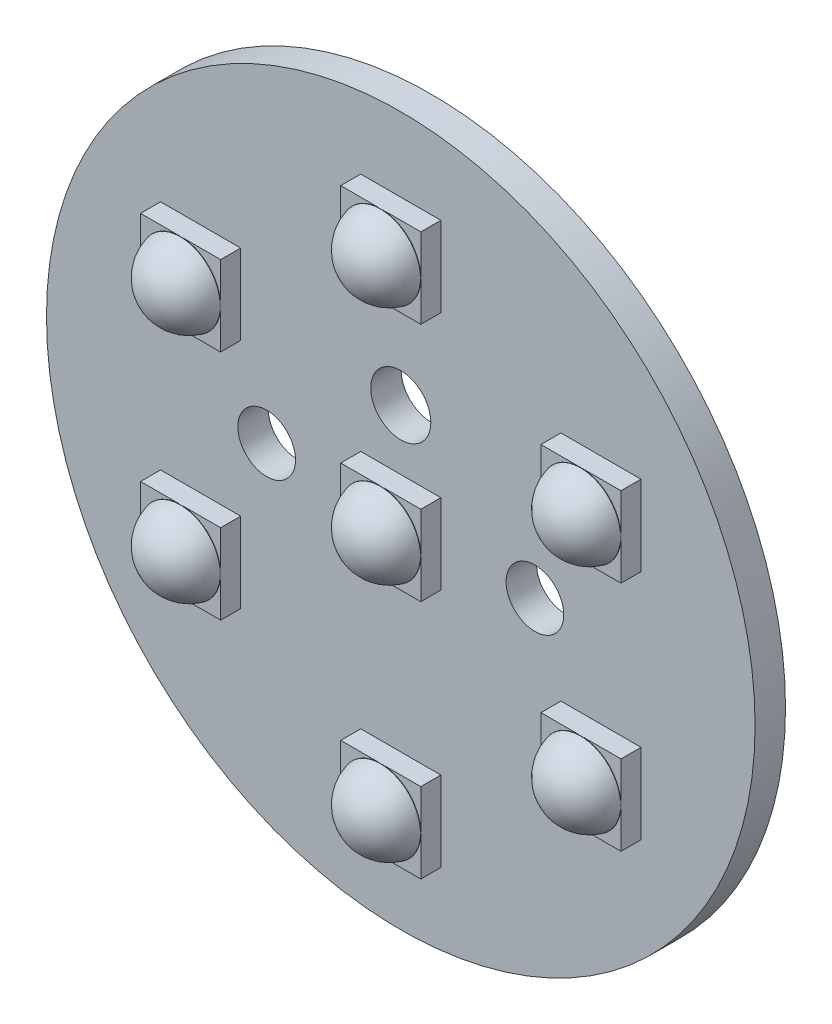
from build123d import *

# Parameters (mm, degrees)
SKETCH1_R           = 22.479
BOSS_EXTRUDE1_DEPTH = 1.9304
SKETCH2_W           = 5.08
SKETCH2_H           = 5.08
BOSS_EXTRUDE2_DEPTH = 1.27
BOSS_EXTRUDE3_DEPTH = 0.0254
DOME1_FACE_RADIUS   = 2.54
DOME1_HEIGHT        = 2.032
DOME2_FACE_RADIUS   = 2.54
DOME2_HEIGHT        = 2.032
DOME3_FACE_RADIUS   = 2.54
DOME3_HEIGHT        = 2.032
DOME4_FACE_RADIUS   = 2.54
DOME4_HEIGHT        = 2.032
DOME5_FACE_RADIUS   = 2.54
DOME5_HEIGHT        = 2.032
DOME6_FACE_RADIUS   = 2.54
DOME6_HEIGHT        = 2.032
DOME7_FACE_RADIUS   = 2.54
DOME7_HEIGHT        = 2.032
SKETCH8_R           = 1.8288
SKETCH8_R_2         = 1.905
CUT_EXTRUDE1_DEPTH  = 32.963768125


with BuildPart() as part:
    # Sketch1 → Boss-Extrude1 (new body)
    with BuildSketch(Plane.XY):
        with Locations(Location((0, 0, 0), (0, 0, 180))):
            Circle(SKETCH1_R)
    extrude(amount=BOSS_EXTRUDE1_DEPTH)

    # Sketch2 → Boss-Extrude2 (add)
    with BuildSketch(Plane.XY.offset(1.9304)):
        with Locations((12.7, 7.366)):
            Rectangle(SKETCH2_W, SKETCH2_H)
        with Locations((0, 15.24)):
            Rectangle(SKETCH2_W, SKETCH2_H)
        with Locations((-12.7, 7.366)):
            Rectangle(SKETCH2_W, SKETCH2_H)
        Rectangle(SKETCH2_W, SKETCH2_H)
        with Locations((12.7, -7.366)):
            Rectangle(SKETCH2_W, SKETCH2_H)
        with Locations((0, -15.24)):
            Rectangle(SKETCH2_W, SKETCH2_H)
        with Locations((-12.7, -7.366)):
            Rectangle(SKETCH2_W, SKETCH2_H)
    extrude(amount=BOSS_EXTRUDE2_DEPTH)

    # Sketch5 → Boss-Extrude3 (add)
    with BuildSketch(Plane.XY.offset(3.2004)):
        with BuildLine():
            ThreePointArc((-12.7, 4.826), (-10.903948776, 5.569948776), (-10.16, 7.366))
            ThreePointArc((-10.16, 7.366), (-10.903948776, 9.162051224), (-12.7, 9.906))
            ThreePointArc((-12.7, 9.906), (-14.496051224, 9.162051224), (-15.24, 7.366))
            ThreePointArc((-15.24, 7.366), (-14.496051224, 5.569948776), (-12.7, 4.826))
        make_face()
        with BuildLine():
            ThreePointArc((0, 12.7), (1.796051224, 13.443948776), (2.54, 15.24))
            ThreePointArc((2.54, 15.24), (1.796051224, 17.036051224), (0, 17.78))
            ThreePointArc((0, 17.78), (-1.796051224, 17.036051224), (-2.54, 15.24))
            ThreePointArc((-2.54, 15.24), (-1.796051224, 13.443948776), (0, 12.7))
        make_face()
        with BuildLine():
            ThreePointArc((0, -2.54), (1.796051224, -1.796051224), (2.54, 0))
            ThreePointArc((2.54, 0), (1.796051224, 1.796051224), (0, 2.54))
            ThreePointArc((0, 2.54), (-1.796051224, 1.796051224), (-2.54, 0))
            ThreePointArc((-2.54, 0), (-1.796051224, -1.796051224), (0, -2.54))
        make_face()
        with BuildLine():
            ThreePointArc((12.7, 4.826), (14.496051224, 5.569948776), (15.24, 7.366))
            ThreePointArc((15.24, 7.366), (14.496051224, 9.162051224), (12.7, 9.906))
            ThreePointArc((12.7, 9.906), (10.903948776, 9.162051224), (10.16, 7.366))
            ThreePointArc((10.16, 7.366), (10.903948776, 5.569948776), (12.7, 4.826))
        make_face()
        with BuildLine():
            ThreePointArc((12.7, -9.906), (14.496051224, -9.162051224), (15.24, -7.366))
            ThreePointArc((15.24, -7.366), (14.496051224, -5.569948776), (12.7, -4.826))
            ThreePointArc((12.7, -4.826), (10.903948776, -5.569948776), (10.16, -7.366))
            ThreePointArc((10.16, -7.366), (10.903948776, -9.162051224), (12.7, -9.906))
        make_face()
        with BuildLine():
            ThreePointArc((0, -17.78), (1.796051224, -17.036051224), (2.54, -15.24))
            ThreePointArc((2.54, -15.24), (1.796051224, -13.443948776), (0, -12.7))
            ThreePointArc((0, -12.7), (-1.796051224, -13.443948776), (-2.54, -15.24))
            ThreePointArc((-2.54, -15.24), (-1.796051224, -17.036051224), (0, -17.78))
        make_face()
        with BuildLine():
            ThreePointArc((-12.7, -9.906), (-10.903948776, -9.162051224), (-10.16, -7.366))
            ThreePointArc((-10.16, -7.366), (-10.903948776, -5.569948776), (-12.7, -4.826))
            ThreePointArc((-12.7, -4.826), (-14.496051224, -5.569948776), (-15.24, -7.366))
            ThreePointArc((-15.24, -7.366), (-14.496051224, -9.162051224), (-12.7, -9.906))
        make_face()
    extrude(amount=BOSS_EXTRUDE3_DEPTH)

    # Dome1: a dome of height H over a round flat face of radius A is a cap of a sphere of radius (A * A + H * H) / (2 * H)
    dome1_r = (DOME1_FACE_RADIUS * DOME1_FACE_RADIUS + DOME1_HEIGHT * DOME1_HEIGHT) / (2 * DOME1_HEIGHT)
    dome1_base = Plane((0, 0, 3.2258), z_dir=(0, 0, 1))
    with Locations(dome1_base.offset(DOME1_HEIGHT - dome1_r)):
        dome1_ball = Sphere(dome1_r, mode=Mode.PRIVATE)
    add(split(dome1_ball, bisect_by=dome1_base, keep=Keep.TOP, mode=Mode.PRIVATE))

    # Dome2: a dome of height H over a round flat face of radius A is a cap of a sphere of radius (A * A + H * H) / (2 * H)
    dome2_r = (DOME2_FACE_RADIUS * DOME2_FACE_RADIUS + DOME2_HEIGHT * DOME2_HEIGHT) / (2 * DOME2_HEIGHT)
    dome2_base = Plane((-12.7, 7.366, 3.2258), z_dir=(0, 0, 1))
    with Locations(dome2_base.offset(DOME2_HEIGHT - dome2_r)):
        dome2_ball = Sphere(dome2_r, mode=Mode.PRIVATE)
    add(split(dome2_ball, bisect_by=dome2_base, keep=Keep.TOP, mode=Mode.PRIVATE))

    # Dome3: a dome of height H over a round flat face of radius A is a cap of a sphere of radius (A * A + H * H) / (2 * H)
    dome3_r = (DOME3_FACE_RADIUS * DOME3_FACE_RADIUS + DOME3_HEIGHT * DOME3_HEIGHT) / (2 * DOME3_HEIGHT)
    dome3_base = Plane((0, 15.24, 3.2258), z_dir=(0, 0, 1))
    with Locations(dome3_base.offset(DOME3_HEIGHT - dome3_r)):
        dome3_ball = Sphere(dome3_r, mode=Mode.PRIVATE)
    add(split(dome3_ball, bisect_by=dome3_base, keep=Keep.TOP, mode=Mode.PRIVATE))

    # Dome4: a dome of height H over a round flat face of radius A is a cap of a sphere of radius (A * A + H * H) / (2 * H)
    dome4_r = (DOME4_FACE_RADIUS * DOME4_FACE_RADIUS + DOME4_HEIGHT * DOME4_HEIGHT) / (2 * DOME4_HEIGHT)
    dome4_base = Plane((12.7, 7.366, 3.2258), z_dir=(0, 0, 1))
    with Locations(dome4_base.offset(DOME4_HEIGHT - dome4_r)):
        dome4_ball = Sphere(dome4_r, mode=Mode.PRIVATE)
    add(split(dome4_ball, bisect_by=dome4_base, keep=Keep.TOP, mode=Mode.PRIVATE))

    # Dome5: a dome of height H over a round flat face of radius A is a cap of a sphere of radius (A * A + H * H) / (2 * H)
    dome5_r = (DOME5_FACE_RADIUS * DOME5_FACE_RADIUS + DOME5_HEIGHT * DOME5_HEIGHT) / (2 * DOME5_HEIGHT)
    dome5_base = Plane((-12.7, -7.366, 3.2258), z_dir=(0, 0, 1))
    with Locations(dome5_base.offset(DOME5_HEIGHT - dome5_r)):
        dome5_ball = Sphere(dome5_r, mode=Mode.PRIVATE)
    add(split(dome5_ball, bisect_by=dome5_base, keep=Keep.TOP, mode=Mode.PRIVATE))

    # Dome6: a dome of height H over a round flat face of radius A is a cap of a sphere of radius (A * A + H * H) / (2 * H)
    dome6_r = (DOME6_FACE_RADIUS * DOME6_FACE_RADIUS + DOME6_HEIGHT * DOME6_HEIGHT) / (2 * DOME6_HEIGHT)
    dome6_base = Plane((12.7, -7.366, 3.2258), z_dir=(0, 0, 1))
    with Locations(dome6_base.offset(DOME6_HEIGHT - dome6_r)):
        dome6_ball = Sphere(dome6_r, mode=Mode.PRIVATE)
    add(split(dome6_ball, bisect_by=dome6_base, keep=Keep.TOP, mode=Mode.PRIVATE))

    # Dome7: a dome of height H over a round flat face of radius A is a cap of a sphere of radius (A * A + H * H) / (2 * H)
    dome7_r = (DOME7_FACE_RADIUS * DOME7_FACE_RADIUS + DOME7_HEIGHT * DOME7_HEIGHT) / (2 * DOME7_HEIGHT)
    dome7_base = Plane((0, -15.24, 3.2258), z_dir=(0, 0, 1))
    with Locations(dome7_base.offset(DOME7_HEIGHT - dome7_r)):
        dome7_ball = Sphere(dome7_r, mode=Mode.PRIVATE)
    add(split(dome7_ball, bisect_by=dome7_base, keep=Keep.TOP, mode=Mode.PRIVATE))

    # Sketch8 → Cut-Extrude1 (cut, through all)
    with BuildSketch(Plane.XY.offset(1.9304)):
        with Locations((-8.509, 0)):
            Circle(SKETCH8_R)
        with Locations((8.509, 0)):
            Circle(SKETCH8_R)
        with Locations((0, 6.35)):
            Circle(SKETCH8_R_2)
    extrude(amount=-CUT_EXTRUDE1_DEPTH, mode=Mode.SUBTRACT)


solid = part.part
